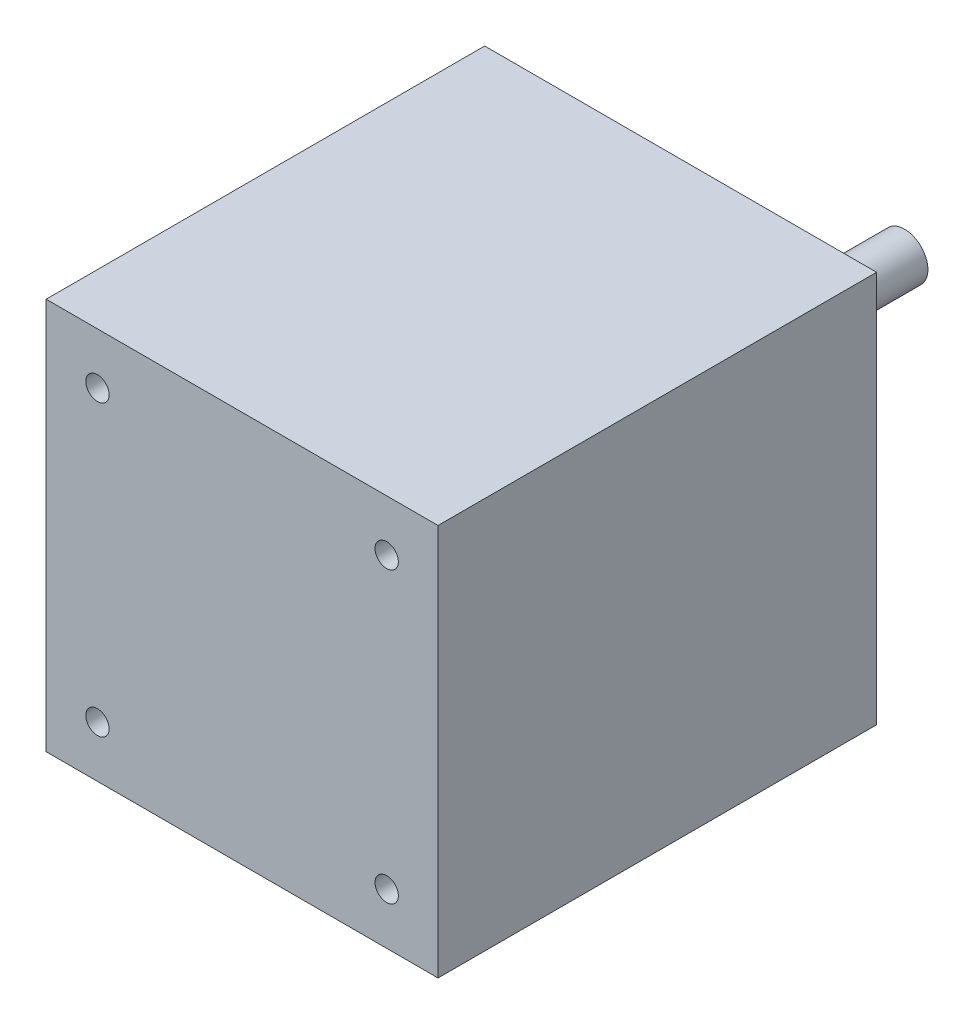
from build123d import *

# Parameters (mm, degrees)
SKETCH1_W           = 42
SKETCH1_H           = 42
SKETCH1_R           = 1.25
BOSS_EXTRUDE1_DEPTH = 47
SKETCH2_R           = 11
BOSS_EXTRUDE2_DEPTH = 2
SKETCH3_R           = 2.5
BOSS_EXTRUDE3_DEPTH = 22


with BuildPart() as part:
    # Sketch1 → Boss-Extrude1 (new body)
    with BuildSketch(Plane.XY):
        Rectangle(SKETCH1_W, SKETCH1_H)
        with Locations((-15.5, 15.5)):
            Circle(SKETCH1_R, mode=Mode.SUBTRACT)
        with Locations(Location((15.5, 15.5, 0), (0, 0, 180))):
            Circle(SKETCH1_R, mode=Mode.SUBTRACT)
        with Locations((15.5, -15.5)):
            Circle(SKETCH1_R, mode=Mode.SUBTRACT)
        with Locations(Location((-15.5, -15.5, 0), (0, 0, 180))):
            Circle(SKETCH1_R, mode=Mode.SUBTRACT)
    extrude(amount=BOSS_EXTRUDE1_DEPTH)

    # Sketch2 → Boss-Extrude2 (add)
    with BuildSketch(Plane(origin=(0, 0, 0), x_dir=(-1, 0, 0), z_dir=(0, 0, -1))):
        with Locations(Location((0, 0, 0), (0, 0, 180))):
            Circle(SKETCH2_R)
    extrude(amount=BOSS_EXTRUDE2_DEPTH)

    # Sketch3 → Boss-Extrude3 (add)
    with BuildSketch(Plane(origin=(0, 0, -2), x_dir=(-1, 0, 0), z_dir=(0, 0, -1))):
        Circle(SKETCH3_R)
    extrude(amount=BOSS_EXTRUDE3_DEPTH)


solid = part.part
